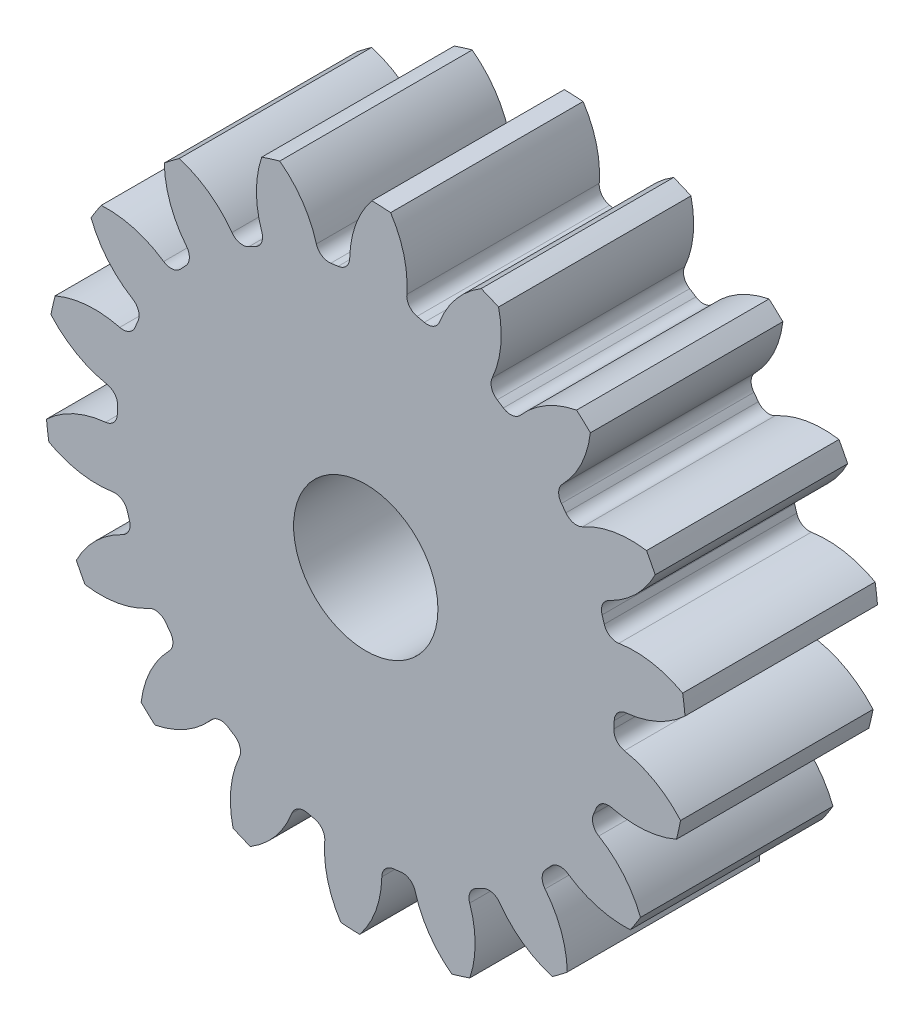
from build123d import *

# Parameters (mm, degrees)
SKETCH3_R         = 169.333333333
GEARBODY_DEPTH    = 101.6
TOOTHCUT_DEPTH    = 261.134802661
CIRPATTERN1_COUNT = 18
BOREDIA_R         = 38.1
BORE_DEPTH        = 12700


with BuildPart() as part:
    # Sketch3 → gearBody (new body)
    with BuildSketch(Plane.XY):
        Circle(SKETCH3_R)
    extrude(amount=GEARBODY_DEPTH)

    # Sketch2 → toothCut (cut, through all)
    with BuildSketch(Plane.XY):
        with BuildLine():
            ThreePointArc((130.972592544, -8.26848112), (131.080706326, -6.327417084), (131.160054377, -4.384964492))
            ThreePointArc((131.160054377, -4.384964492), (133.023993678, 0.102428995), (137.385381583, 2.244686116))
            ThreePointArc((137.385381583, 2.244686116), (154.640615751, 6.955137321), (169.333333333, 17.155897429))
            ThreePointArc((169.333333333, 17.155897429), (170.002237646, -8.206204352), (166.893619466, -33.38596076))
            ThreePointArc((166.893619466, -33.38596076), (153.251729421, -21.817456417), (136.530421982, -15.466918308))
            ThreePointArc((136.530421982, -15.466918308), (132.395649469, -12.914541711), (130.972592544, -8.26848112))
        make_face()
    toothcut = extrude(amount=TOOTHCUT_DEPTH, mode=Mode.SUBTRACT)

    # CirPattern1: toothCut ×18 about axis
    cirpattern1_axis = Axis((0, 0, 0), (0, 0, 1))
    for i in range(1, CIRPATTERN1_COUNT):
        add(toothcut.rotate(cirpattern1_axis, i * 360 / CIRPATTERN1_COUNT), mode=Mode.SUBTRACT)

    # boreDia → bore (cut, symmetric)
    with BuildSketch(Plane.XY):
        Circle(BOREDIA_R)
    extrude(amount=BORE_DEPTH, both=True, mode=Mode.SUBTRACT)


solid = part.part
